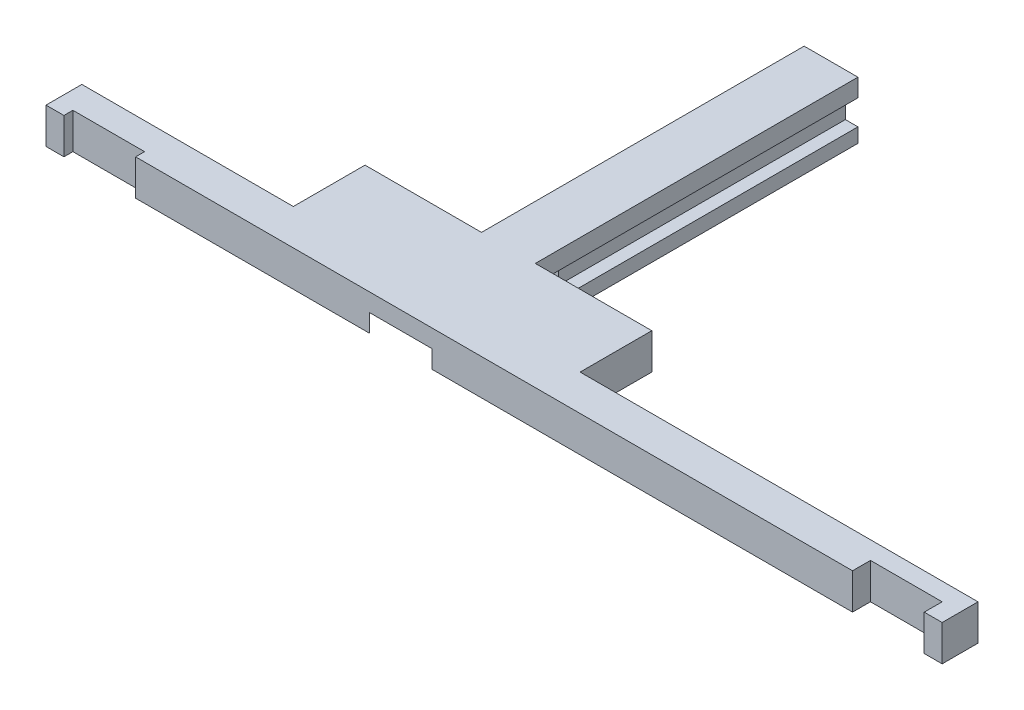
from build123d import *

# Parameters (mm, degrees)
EXTRUDE_1_DEPTH     = 10
CUT_EXTRUDE_START   = -10
SKETCH_3_R          = 20
CUT_EXTRUDE_1_DEPTH = 5
SKETCH_4_W          = 59
SKETCH_4_H          = 20
SKETCH_4_W_2        = 111
CUT_EXTRUDE_2_DEPTH = 10
SKETCH_5_R          = 2
EXTRUDE_2_DEPTH     = 10
SKETCH_6_W          = 15
SKETCH_6_H          = 5
EXTRUDE_3_DEPTH     = 10
EXTRUDE_4_DEPTH     = 80


with BuildPart() as part:
    # Sketch 2 → Extrude 1 (new body)
    with BuildSketch(Plane(origin=(0, 0, 0), x_dir=(1, 0, 0), z_dir=(0, 1, 0))):
        Polygon((-99, 30), (151, 30), (151, 0), (146, 0), (146, 5), (126, 5), (126, 0), (-74, 0), (-74, 2.5), (-94, 2.5), (-94, 0), (-99, 0), align=None)
    extrude(amount=EXTRUDE_1_DEPTH)

    # Sketch 3 → Cut-Extrude 1 (cut)
    with BuildSketch(Plane(origin=(0, 10, 0), x_dir=(1, 0, 0), z_dir=(0, 1, 0)).offset(CUT_EXTRUDE_START)):
        with Locations((0, 18)):
            Circle(SKETCH_3_R)
    extrude(amount=CUT_EXTRUDE_1_DEPTH, mode=Mode.SUBTRACT)

    # Sketch 4 → Cut-Extrude 2 (cut)
    with BuildSketch(Plane(origin=(0, 10, 0), x_dir=(1, 0, 0), z_dir=(0, 1, 0))):
        with Locations((-69.5, 20)):
            Rectangle(SKETCH_4_W, SKETCH_4_H)
        with Locations((95.5, 20)):
            Rectangle(SKETCH_4_W_2, SKETCH_4_H)
    extrude(amount=-CUT_EXTRUDE_2_DEPTH, mode=Mode.SUBTRACT)

    # Sketch 5 → Extrude 2 (add)
    with BuildSketch(Plane.XZ):
        with Locations(Location((-30, -18, 0), (0, 0, 270))):
            Circle(SKETCH_5_R)
        with Locations(Location((30, -18, 0), (0, 0, 90))):
            Circle(SKETCH_5_R)
    extrude(amount=EXTRUDE_2_DEPTH)

    # Sketch 6 → Extrude 3 (add)
    with BuildSketch(Plane(origin=(0, 0, -30), x_dir=(-1, 0, 0), z_dir=(0, 0, -1))):
        with Locations((0, 7.5)):
            Rectangle(SKETCH_6_W, SKETCH_6_H)
    extrude(amount=EXTRUDE_3_DEPTH)

    # Sketch 8 → Extrude 4 (add)
    with BuildSketch(Plane(origin=(0, 0, -40), x_dir=(-1, 0, 0), z_dir=(0, 0, -1))):
        Polygon((-7.5, 10), (7.5, 10), (7.5, 5), (4, 5), (4, -2), (7.5, -2), (7.5, -6), (-7.5, -6), (-7.5, -2), (-4, -2), (-4, 5), (-7.5, 5), align=None)
    extrude(amount=EXTRUDE_4_DEPTH)


solid = part.part
